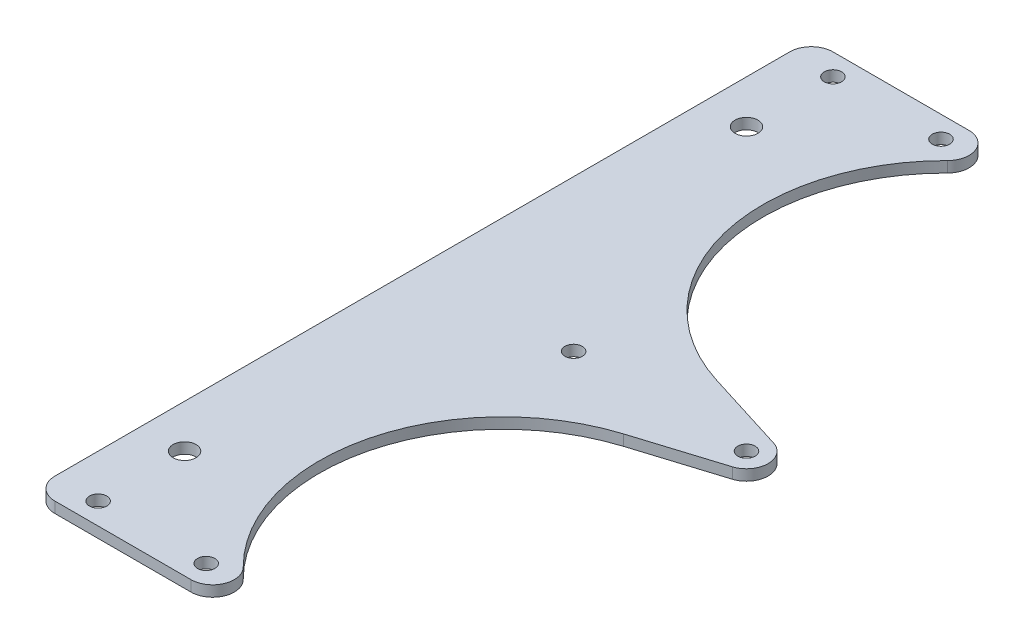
ISO-10303-21;
HEADER;
FILE_DESCRIPTION(('STEP AP214'),'2;1');
FILE_NAME('part.step','',(''),(''),'','','');
FILE_SCHEMA(('AUTOMOTIVE_DESIGN { 1 0 10303 214 1 1 1 1 }'));
ENDSEC;
DATA;
#1=APPLICATION_CONTEXT('core data for automotive mechanical design processes');
#2=APPLICATION_PROTOCOL_DEFINITION('international standard','automotive_design',2000,#1);
#3=PRODUCT_CONTEXT('',#1,'mechanical');
#4=PRODUCT('Part','Part','',(#3));
#5=PRODUCT_RELATED_PRODUCT_CATEGORY('part','',(#4));
#6=PRODUCT_DEFINITION_FORMATION('','',#4);
#7=PRODUCT_DEFINITION_CONTEXT('part definition',#1,'design');
#8=PRODUCT_DEFINITION('design','',#6,#7);
#9=PRODUCT_DEFINITION_SHAPE('','',#8);
#10=(LENGTH_UNIT() NAMED_UNIT(*) SI_UNIT(.MILLI.,.METRE.));
#11=(NAMED_UNIT(*) PLANE_ANGLE_UNIT() SI_UNIT($,.RADIAN.));
#12=(NAMED_UNIT(*) SI_UNIT($,.STERADIAN.) SOLID_ANGLE_UNIT());
#13=UNCERTAINTY_MEASURE_WITH_UNIT(LENGTH_MEASURE(1.E-05),#10,'distance_accuracy_value','');
#14=(GEOMETRIC_REPRESENTATION_CONTEXT(3) GLOBAL_UNCERTAINTY_ASSIGNED_CONTEXT((#13)) GLOBAL_UNIT_ASSIGNED_CONTEXT((#10,
#11,#12)) REPRESENTATION_CONTEXT('',''));
#15=CARTESIAN_POINT('',(0.,0.,0.));
#16=DIRECTION('',(0.,0.,1.));
#17=DIRECTION('',(1.,0.,0.));
#18=AXIS2_PLACEMENT_3D('',#15,#16,#17);
#19=CARTESIAN_POINT('',(46.3487243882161,3.175,-6.35));
#20=DIRECTION('',(0.,-1.,0.));
#21=DIRECTION('',(0.,0.,-1.));
#22=AXIS2_PLACEMENT_3D('',#19,#20,#21);
#23=CYLINDRICAL_SURFACE('',#22,6.35000000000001);
#24=CARTESIAN_POINT('',(46.3487243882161,0.,-6.35));
#25=DIRECTION('',(0.,1.,0.));
#26=DIRECTION('',(0.,0.,1.));
#27=AXIS2_PLACEMENT_3D('',#24,#25,#26);
#28=CIRCLE('',#27,6.35000000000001);
#29=CARTESIAN_POINT('',(46.3487243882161,0.,0.));
#30=VERTEX_POINT('',#29);
#31=CARTESIAN_POINT('',(50.8278060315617,0.,-10.8511473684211));
#32=VERTEX_POINT('',#31);
#33=EDGE_CURVE('E174',#30,#32,#28,.T.);
#34=ORIENTED_EDGE('',*,*,#33,.T.);
#35=DIRECTION('',(0.,-1.,0.));
#36=VECTOR('',#35,1.);
#37=CARTESIAN_POINT('',(50.8278060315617,3.175,-10.8511473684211));
#38=LINE('',#37,#36);
#39=CARTESIAN_POINT('',(50.8278060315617,3.175,-10.8511473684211));
#40=VERTEX_POINT('',#39);
#41=EDGE_CURVE('E13',#40,#32,#38,.T.);
#42=ORIENTED_EDGE('',*,*,#41,.F.);
#43=CARTESIAN_POINT('',(46.3487243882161,3.175,-6.35));
#44=DIRECTION('',(0.,1.,0.));
#45=DIRECTION('',(0.,0.,1.));
#46=AXIS2_PLACEMENT_3D('',#43,#44,#45);
#47=CIRCLE('',#46,6.35000000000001);
#48=CARTESIAN_POINT('',(46.3487243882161,3.175,0.));
#49=VERTEX_POINT('',#48);
#50=EDGE_CURVE('E209',#49,#40,#47,.T.);
#51=ORIENTED_EDGE('',*,*,#50,.F.);
#52=DIRECTION('',(0.,-1.,0.));
#53=VECTOR('',#52,1.);
#54=CARTESIAN_POINT('',(46.3487243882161,3.175,0.));
#55=LINE('',#54,#53);
#56=EDGE_CURVE('E170',#49,#30,#55,.T.);
#57=ORIENTED_EDGE('',*,*,#56,.T.);
#58=EDGE_LOOP('',(#34,#42,#51,#57));
#59=FACE_BOUND('',#58,.T.);
#60=ADVANCED_FACE('F48',(#59),#23,.T.);
#61=CARTESIAN_POINT('',(88.9,3.175,-49.1109));
#62=DIRECTION('',(0.,-1.,0.));
#63=DIRECTION('',(0.,0.,-1.));
#64=AXIS2_PLACEMENT_3D('',#61,#62,#63);
#65=CYLINDRICAL_SURFACE('',#64,53.975);
#66=CARTESIAN_POINT('',(88.9,0.,-49.1109));
#67=DIRECTION('',(0.,-1.,0.));
#68=DIRECTION('',(0.,0.,1.));
#69=AXIS2_PLACEMENT_3D('',#66,#67,#68);
#70=CIRCLE('',#69,53.975);
#71=CARTESIAN_POINT('',(72.7952662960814,0.,-100.627287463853));
#72=VERTEX_POINT('',#71);
#73=EDGE_CURVE('E178',#32,#72,#70,.T.);
#74=ORIENTED_EDGE('',*,*,#73,.T.);
#75=DIRECTION('',(0.,-1.,0.));
#76=VECTOR('',#75,1.);
#77=CARTESIAN_POINT('',(72.7952662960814,3.175,-100.627287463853));
#78=LINE('',#77,#76);
#79=CARTESIAN_POINT('',(72.7952662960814,3.175,-100.627287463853));
#80=VERTEX_POINT('',#79);
#81=EDGE_CURVE('E57',#80,#72,#78,.T.);
#82=ORIENTED_EDGE('',*,*,#81,.F.);
#83=CARTESIAN_POINT('',(88.9,3.175,-49.1109));
#84=DIRECTION('',(0.,-1.,0.));
#85=DIRECTION('',(0.,0.,1.));
#86=AXIS2_PLACEMENT_3D('',#83,#84,#85);
#87=CIRCLE('',#86,53.975);
#88=EDGE_CURVE('E120',#40,#80,#87,.T.);
#89=ORIENTED_EDGE('',*,*,#88,.F.);
#90=ORIENTED_EDGE('',*,*,#41,.T.);
#91=EDGE_LOOP('',(#74,#82,#89,#90));
#92=FACE_BOUND('',#91,.T.);
#93=ADVANCED_FACE('F311',(#92),#65,.F.);
#94=CARTESIAN_POINT('',(97.1446745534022,3.175,-108.239248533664));
#95=DIRECTION('',(-0.298373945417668,0.,-0.954449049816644));
#96=DIRECTION('',(-0.954449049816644,0.,0.298373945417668));
#97=AXIS2_PLACEMENT_3D('',#94,#95,#96);
#98=PLANE('',#97);
#99=DIRECTION('',(0.954449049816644,0.,-0.298373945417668));
#100=VECTOR('',#99,1.);
#101=CARTESIAN_POINT('',(97.1446745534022,0.,-108.239248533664));
#102=LINE('',#101,#100);
#103=CARTESIAN_POINT('',(97.1446745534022,0.,-108.239248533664));
#104=VERTEX_POINT('',#103);
#105=EDGE_CURVE('E182',#72,#104,#102,.T.);
#106=ORIENTED_EDGE('',*,*,#105,.T.);
#107=DIRECTION('',(0.,-1.,0.));
#108=VECTOR('',#107,1.);
#109=CARTESIAN_POINT('',(97.1446745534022,3.175,-108.239248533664));
#110=LINE('',#109,#108);
#111=CARTESIAN_POINT('',(97.1446745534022,3.175,-108.239248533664));
#112=VERTEX_POINT('',#111);
#113=EDGE_CURVE('E236',#112,#104,#110,.T.);
#114=ORIENTED_EDGE('',*,*,#113,.F.);
#115=DIRECTION('',(0.954449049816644,0.,-0.298373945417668));
#116=VECTOR('',#115,1.);
#117=CARTESIAN_POINT('',(97.1446745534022,3.175,-108.239248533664));
#118=LINE('',#117,#116);
#119=EDGE_CURVE('E247',#80,#112,#118,.T.);
#120=ORIENTED_EDGE('',*,*,#119,.F.);
#121=ORIENTED_EDGE('',*,*,#81,.T.);
#122=EDGE_LOOP('',(#106,#114,#120,#121));
#123=FACE_BOUND('',#122,.T.);
#124=ADVANCED_FACE('F245',(#123),#98,.F.);
#125=CARTESIAN_POINT('',(95.25,3.175,-114.3));
#126=DIRECTION('',(0.,-1.,0.));
#127=DIRECTION('',(0.,0.,-1.));
#128=AXIS2_PLACEMENT_3D('',#125,#126,#127);
#129=CYLINDRICAL_SURFACE('',#128,6.35);
#130=CARTESIAN_POINT('',(95.25,0.,-114.3));
#131=DIRECTION('',(0.,1.,0.));
#132=DIRECTION('',(0.,0.,-1.));
#133=AXIS2_PLACEMENT_3D('',#130,#131,#132);
#134=CIRCLE('',#133,6.35);
#135=CARTESIAN_POINT('',(97.1446745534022,0.,-120.360751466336));
#136=VERTEX_POINT('',#135);
#137=EDGE_CURVE('E185',#104,#136,#134,.T.);
#138=ORIENTED_EDGE('',*,*,#137,.T.);
#139=DIRECTION('',(0.,-1.,0.));
#140=VECTOR('',#139,1.);
#141=CARTESIAN_POINT('',(97.1446745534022,3.175,-120.360751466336));
#142=LINE('',#141,#140);
#143=CARTESIAN_POINT('',(97.1446745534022,3.175,-120.360751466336));
#144=VERTEX_POINT('',#143);
#145=EDGE_CURVE('E232',#144,#136,#142,.T.);
#146=ORIENTED_EDGE('',*,*,#145,.F.);
#147=CARTESIAN_POINT('',(95.25,3.175,-114.3));
#148=DIRECTION('',(0.,1.,0.));
#149=DIRECTION('',(0.,0.,-1.));
#150=AXIS2_PLACEMENT_3D('',#147,#148,#149);
#151=CIRCLE('',#150,6.35);
#152=EDGE_CURVE('E266',#112,#144,#151,.T.);
#153=ORIENTED_EDGE('',*,*,#152,.F.);
#154=ORIENTED_EDGE('',*,*,#113,.T.);
#155=EDGE_LOOP('',(#138,#146,#153,#154));
#156=FACE_BOUND('',#155,.T.);
#157=ADVANCED_FACE('F256',(#156),#129,.T.);
#158=CARTESIAN_POINT('',(72.7952662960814,3.175,-127.972712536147));
#159=DIRECTION('',(-0.298373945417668,0.,0.954449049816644));
#160=DIRECTION('',(0.954449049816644,0.,0.298373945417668));
#161=AXIS2_PLACEMENT_3D('',#158,#159,#160);
#162=PLANE('',#161);
#163=DIRECTION('',(-0.954449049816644,0.,-0.298373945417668));
#164=VECTOR('',#163,1.);
#165=CARTESIAN_POINT('',(72.7952662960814,0.,-127.972712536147));
#166=LINE('',#165,#164);
#167=CARTESIAN_POINT('',(72.7952662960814,0.,-127.972712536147));
#168=VERTEX_POINT('',#167);
#169=EDGE_CURVE('E188',#136,#168,#166,.T.);
#170=ORIENTED_EDGE('',*,*,#169,.T.);
#171=DIRECTION('',(0.,-1.,0.));
#172=VECTOR('',#171,1.);
#173=CARTESIAN_POINT('',(72.7952662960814,3.175,-127.972712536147));
#174=LINE('',#173,#172);
#175=CARTESIAN_POINT('',(72.7952662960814,3.175,-127.972712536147));
#176=VERTEX_POINT('',#175);
#177=EDGE_CURVE('E228',#176,#168,#174,.T.);
#178=ORIENTED_EDGE('',*,*,#177,.F.);
#179=DIRECTION('',(-0.954449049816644,0.,-0.298373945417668));
#180=VECTOR('',#179,1.);
#181=CARTESIAN_POINT('',(72.7952662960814,3.175,-127.972712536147));
#182=LINE('',#181,#180);
#183=EDGE_CURVE('E262',#144,#176,#182,.T.);
#184=ORIENTED_EDGE('',*,*,#183,.F.);
#185=ORIENTED_EDGE('',*,*,#145,.T.);
#186=EDGE_LOOP('',(#170,#178,#184,#185));
#187=FACE_BOUND('',#186,.T.);
#188=ADVANCED_FACE('F260',(#187),#162,.F.);
#189=CARTESIAN_POINT('',(88.9,3.175,-179.4891));
#190=DIRECTION('',(0.,-1.,0.));
#191=DIRECTION('',(0.,0.,-1.));
#192=AXIS2_PLACEMENT_3D('',#189,#190,#191);
#193=CYLINDRICAL_SURFACE('',#192,53.975);
#194=CARTESIAN_POINT('',(88.9,0.,-179.4891));
#195=DIRECTION('',(0.,-1.,0.));
#196=DIRECTION('',(0.,0.,1.));
#197=AXIS2_PLACEMENT_3D('',#194,#195,#196);
#198=CIRCLE('',#197,53.975);
#199=CARTESIAN_POINT('',(50.8278060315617,0.,-217.748852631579));
#200=VERTEX_POINT('',#199);
#201=EDGE_CURVE('E191',#168,#200,#198,.T.);
#202=ORIENTED_EDGE('',*,*,#201,.T.);
#203=DIRECTION('',(0.,-1.,0.));
#204=VECTOR('',#203,1.);
#205=CARTESIAN_POINT('',(50.8278060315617,3.175,-217.748852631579));
#206=LINE('',#205,#204);
#207=CARTESIAN_POINT('',(50.8278060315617,3.175,-217.748852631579));
#208=VERTEX_POINT('',#207);
#209=EDGE_CURVE('E224',#208,#200,#206,.T.);
#210=ORIENTED_EDGE('',*,*,#209,.F.);
#211=CARTESIAN_POINT('',(88.9,3.175,-179.4891));
#212=DIRECTION('',(0.,-1.,0.));
#213=DIRECTION('',(0.,0.,1.));
#214=AXIS2_PLACEMENT_3D('',#211,#212,#213);
#215=CIRCLE('',#214,53.975);
#216=EDGE_CURVE('E265',#176,#208,#215,.T.);
#217=ORIENTED_EDGE('',*,*,#216,.F.);
#218=ORIENTED_EDGE('',*,*,#177,.T.);
#219=EDGE_LOOP('',(#202,#210,#217,#218));
#220=FACE_BOUND('',#219,.T.);
#221=ADVANCED_FACE('F324',(#220),#193,.F.);
#222=CARTESIAN_POINT('',(46.348724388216,3.175,-222.25));
#223=DIRECTION('',(0.,-1.,0.));
#224=DIRECTION('',(0.,0.,-1.));
#225=AXIS2_PLACEMENT_3D('',#222,#223,#224);
#226=CYLINDRICAL_SURFACE('',#225,6.35);
#227=CARTESIAN_POINT('',(46.348724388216,0.,-222.25));
#228=DIRECTION('',(0.,1.,0.));
#229=DIRECTION('',(0.,0.,1.));
#230=AXIS2_PLACEMENT_3D('',#227,#228,#229);
#231=CIRCLE('',#230,6.35);
#232=CARTESIAN_POINT('',(46.348724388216,0.,-228.6));
#233=VERTEX_POINT('',#232);
#234=EDGE_CURVE('E194',#200,#233,#231,.T.);
#235=ORIENTED_EDGE('',*,*,#234,.T.);
#236=DIRECTION('',(0.,-1.,0.));
#237=VECTOR('',#236,1.);
#238=CARTESIAN_POINT('',(46.348724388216,3.175,-228.6));
#239=LINE('',#238,#237);
#240=CARTESIAN_POINT('',(46.348724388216,3.175,-228.6));
#241=VERTEX_POINT('',#240);
#242=EDGE_CURVE('E220',#241,#233,#239,.T.);
#243=ORIENTED_EDGE('',*,*,#242,.F.);
#244=CARTESIAN_POINT('',(46.348724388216,3.175,-222.25));
#245=DIRECTION('',(0.,1.,0.));
#246=DIRECTION('',(0.,0.,1.));
#247=AXIS2_PLACEMENT_3D('',#244,#245,#246);
#248=CIRCLE('',#247,6.35);
#249=EDGE_CURVE('E271',#208,#241,#248,.T.);
#250=ORIENTED_EDGE('',*,*,#249,.F.);
#251=ORIENTED_EDGE('',*,*,#209,.T.);
#252=EDGE_LOOP('',(#235,#243,#250,#251));
#253=FACE_BOUND('',#252,.T.);
#254=ADVANCED_FACE('F327',(#253),#226,.T.);
#255=CARTESIAN_POINT('',(6.35000000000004,3.175,-228.6));
#256=DIRECTION('',(0.,0.,1.));
#257=DIRECTION('',(1.,0.,0.));
#258=AXIS2_PLACEMENT_3D('',#255,#256,#257);
#259=PLANE('',#258);
#260=DIRECTION('',(-1.,0.,0.));
#261=VECTOR('',#260,1.);
#262=CARTESIAN_POINT('',(6.35000000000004,0.,-228.6));
#263=LINE('',#262,#261);
#264=CARTESIAN_POINT('',(6.35,0.,-228.6));
#265=VERTEX_POINT('',#264);
#266=EDGE_CURVE('E197',#233,#265,#263,.T.);
#267=ORIENTED_EDGE('',*,*,#266,.T.);
#268=DIRECTION('',(0.,-1.,0.));
#269=VECTOR('',#268,1.);
#270=CARTESIAN_POINT('',(6.35,3.175,-228.6));
#271=LINE('',#270,#269);
#272=CARTESIAN_POINT('',(6.35,3.175,-228.6));
#273=VERTEX_POINT('',#272);
#274=EDGE_CURVE('E216',#273,#265,#271,.T.);
#275=ORIENTED_EDGE('',*,*,#274,.F.);
#276=DIRECTION('',(-1.,0.,0.));
#277=VECTOR('',#276,1.);
#278=CARTESIAN_POINT('',(6.35000000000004,3.175,-228.6));
#279=LINE('',#278,#277);
#280=EDGE_CURVE('E278',#241,#273,#279,.T.);
#281=ORIENTED_EDGE('',*,*,#280,.F.);
#282=ORIENTED_EDGE('',*,*,#242,.T.);
#283=EDGE_LOOP('',(#267,#275,#281,#282));
#284=FACE_BOUND('',#283,.T.);
#285=ADVANCED_FACE('F291',(#284),#259,.F.);
#286=CARTESIAN_POINT('',(6.35,3.175,-222.25));
#287=DIRECTION('',(0.,-1.,0.));
#288=DIRECTION('',(0.,0.,-1.));
#289=AXIS2_PLACEMENT_3D('',#286,#287,#288);
#290=CYLINDRICAL_SURFACE('',#289,6.35);
#291=CARTESIAN_POINT('',(6.35,0.,-222.25));
#292=DIRECTION('',(0.,1.,0.));
#293=DIRECTION('',(0.,0.,-1.));
#294=AXIS2_PLACEMENT_3D('',#291,#292,#293);
#295=CIRCLE('',#294,6.35);
#296=CARTESIAN_POINT('',(0.,0.,-222.25));
#297=VERTEX_POINT('',#296);
#298=EDGE_CURVE('E200',#265,#297,#295,.T.);
#299=ORIENTED_EDGE('',*,*,#298,.T.);
#300=DIRECTION('',(0.,-1.,0.));
#301=VECTOR('',#300,1.);
#302=CARTESIAN_POINT('',(0.,3.175,-222.25));
#303=LINE('',#302,#301);
#304=CARTESIAN_POINT('',(0.,3.175,-222.25));
#305=VERTEX_POINT('',#304);
#306=EDGE_CURVE('E162',#305,#297,#303,.T.);
#307=ORIENTED_EDGE('',*,*,#306,.F.);
#308=CARTESIAN_POINT('',(6.35,3.175,-222.25));
#309=DIRECTION('',(0.,1.,0.));
#310=DIRECTION('',(0.,0.,-1.));
#311=AXIS2_PLACEMENT_3D('',#308,#309,#310);
#312=CIRCLE('',#311,6.35);
#313=EDGE_CURVE('E151',#273,#305,#312,.T.);
#314=ORIENTED_EDGE('',*,*,#313,.F.);
#315=ORIENTED_EDGE('',*,*,#274,.T.);
#316=EDGE_LOOP('',(#299,#307,#314,#315));
#317=FACE_BOUND('',#316,.T.);
#318=ADVANCED_FACE('F295',(#317),#290,.T.);
#319=CARTESIAN_POINT('',(0.,3.175,-6.35000000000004));
#320=DIRECTION('',(1.,0.,0.));
#321=DIRECTION('',(0.,0.,-1.));
#322=AXIS2_PLACEMENT_3D('',#319,#320,#321);
#323=PLANE('',#322);
#324=DIRECTION('',(0.,0.,1.));
#325=VECTOR('',#324,1.);
#326=CARTESIAN_POINT('',(0.,0.,-6.35000000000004));
#327=LINE('',#326,#325);
#328=CARTESIAN_POINT('',(0.,0.,-6.35000000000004));
#329=VERTEX_POINT('',#328);
#330=EDGE_CURVE('E160',#297,#329,#327,.T.);
#331=ORIENTED_EDGE('',*,*,#330,.T.);
#332=DIRECTION('',(0.,-1.,0.));
#333=VECTOR('',#332,1.);
#334=CARTESIAN_POINT('',(0.,3.175,-6.35000000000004));
#335=LINE('',#334,#333);
#336=CARTESIAN_POINT('',(0.,3.175,-6.35000000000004));
#337=VERTEX_POINT('',#336);
#338=EDGE_CURVE('E157',#337,#329,#335,.T.);
#339=ORIENTED_EDGE('',*,*,#338,.F.);
#340=DIRECTION('',(0.,0.,1.));
#341=VECTOR('',#340,1.);
#342=CARTESIAN_POINT('',(0.,3.175,-6.35000000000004));
#343=LINE('',#342,#341);
#344=EDGE_CURVE('E145',#305,#337,#343,.T.);
#345=ORIENTED_EDGE('',*,*,#344,.F.);
#346=ORIENTED_EDGE('',*,*,#306,.T.);
#347=EDGE_LOOP('',(#331,#339,#345,#346));
#348=FACE_BOUND('',#347,.T.);
#349=ADVANCED_FACE('F158',(#348),#323,.F.);
#350=CARTESIAN_POINT('',(6.35,3.175,-6.35));
#351=DIRECTION('',(0.,-1.,0.));
#352=DIRECTION('',(0.,0.,-1.));
#353=AXIS2_PLACEMENT_3D('',#350,#351,#352);
#354=CYLINDRICAL_SURFACE('',#353,6.35);
#355=CARTESIAN_POINT('',(6.35,0.,-6.35));
#356=DIRECTION('',(0.,1.,0.));
#357=DIRECTION('',(0.,0.,1.));
#358=AXIS2_PLACEMENT_3D('',#355,#356,#357);
#359=CIRCLE('',#358,6.35);
#360=CARTESIAN_POINT('',(6.35000000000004,0.,0.));
#361=VERTEX_POINT('',#360);
#362=EDGE_CURVE('E106',#329,#361,#359,.T.);
#363=ORIENTED_EDGE('',*,*,#362,.T.);
#364=DIRECTION('',(0.,-1.,0.));
#365=VECTOR('',#364,1.);
#366=CARTESIAN_POINT('',(6.35000000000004,3.175,0.));
#367=LINE('',#366,#365);
#368=CARTESIAN_POINT('',(6.35000000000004,3.175,0.));
#369=VERTEX_POINT('',#368);
#370=EDGE_CURVE('E163',#369,#361,#367,.T.);
#371=ORIENTED_EDGE('',*,*,#370,.F.);
#372=CARTESIAN_POINT('',(6.35,3.175,-6.35));
#373=DIRECTION('',(0.,1.,0.));
#374=DIRECTION('',(0.,0.,1.));
#375=AXIS2_PLACEMENT_3D('',#372,#373,#374);
#376=CIRCLE('',#375,6.35);
#377=EDGE_CURVE('E149',#337,#369,#376,.T.);
#378=ORIENTED_EDGE('',*,*,#377,.F.);
#379=ORIENTED_EDGE('',*,*,#338,.T.);
#380=EDGE_LOOP('',(#363,#371,#378,#379));
#381=FACE_BOUND('',#380,.T.);
#382=ADVANCED_FACE('F165',(#381),#354,.T.);
#383=CARTESIAN_POINT('',(6.35000000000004,3.175,0.));
#384=DIRECTION('',(0.,0.,-1.));
#385=DIRECTION('',(-1.,0.,0.));
#386=AXIS2_PLACEMENT_3D('',#383,#384,#385);
#387=PLANE('',#386);
#388=DIRECTION('',(1.,0.,0.));
#389=VECTOR('',#388,1.);
#390=CARTESIAN_POINT('',(6.35000000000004,0.,0.));
#391=LINE('',#390,#389);
#392=EDGE_CURVE('E112',#361,#30,#391,.T.);
#393=ORIENTED_EDGE('',*,*,#392,.T.);
#394=ORIENTED_EDGE('',*,*,#56,.F.);
#395=DIRECTION('',(1.,0.,0.));
#396=VECTOR('',#395,1.);
#397=CARTESIAN_POINT('',(6.35000000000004,3.175,0.));
#398=LINE('',#397,#396);
#399=EDGE_CURVE('E65',#369,#49,#398,.T.);
#400=ORIENTED_EDGE('',*,*,#399,.F.);
#401=ORIENTED_EDGE('',*,*,#370,.T.);
#402=EDGE_LOOP('',(#393,#394,#400,#401));
#403=FACE_BOUND('',#402,.T.);
#404=ADVANCED_FACE('F299',(#403),#387,.F.);
#405=CARTESIAN_POINT('',(46.3487243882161,3.175,-6.35));
#406=DIRECTION('',(0.,1.,0.));
#407=DIRECTION('',(0.,0.,1.));
#408=AXIS2_PLACEMENT_3D('',#405,#406,#407);
#409=PLANE('',#408);
#410=CARTESIAN_POINT('',(12.7,3.175,-196.85));
#411=DIRECTION('',(0.,1.,0.));
#412=DIRECTION('',(0.,0.,1.));
#413=AXIS2_PLACEMENT_3D('',#410,#411,#412);
#414=CIRCLE('',#413,3.37350099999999);
#415=CARTESIAN_POINT('',(12.7,3.175,-193.476499));
#416=VERTEX_POINT('',#415);
#417=EDGE_CURVE('E547',#416,#416,#414,.T.);
#418=ORIENTED_EDGE('',*,*,#417,.F.);
#419=EDGE_LOOP('',(#418));
#420=FACE_BOUND('',#419,.T.);
#421=CARTESIAN_POINT('',(12.7,3.175,-31.75));
#422=DIRECTION('',(0.,1.,0.));
#423=DIRECTION('',(0.,0.,1.));
#424=AXIS2_PLACEMENT_3D('',#421,#422,#423);
#425=CIRCLE('',#424,3.37350099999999);
#426=CARTESIAN_POINT('',(12.7,3.175,-28.376499));
#427=VERTEX_POINT('',#426);
#428=EDGE_CURVE('E552',#427,#427,#425,.T.);
#429=ORIENTED_EDGE('',*,*,#428,.F.);
#430=EDGE_LOOP('',(#429));
#431=FACE_BOUND('',#430,.T.);
#432=CARTESIAN_POINT('',(95.25,3.175,-114.3));
#433=DIRECTION('',(0.,1.,0.));
#434=DIRECTION('',(0.,0.,1.));
#435=AXIS2_PLACEMENT_3D('',#432,#433,#434);
#436=CIRCLE('',#435,2.55269999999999);
#437=CARTESIAN_POINT('',(95.25,3.175,-111.7473));
#438=VERTEX_POINT('',#437);
#439=EDGE_CURVE('E562',#438,#438,#436,.T.);
#440=ORIENTED_EDGE('',*,*,#439,.F.);
#441=EDGE_LOOP('',(#440));
#442=FACE_BOUND('',#441,.T.);
#443=CARTESIAN_POINT('',(44.45,3.175,-114.3));
#444=DIRECTION('',(0.,1.,0.));
#445=DIRECTION('',(0.,0.,1.));
#446=AXIS2_PLACEMENT_3D('',#443,#444,#445);
#447=CIRCLE('',#446,2.55269999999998);
#448=CARTESIAN_POINT('',(44.45,3.175,-111.7473));
#449=VERTEX_POINT('',#448);
#450=EDGE_CURVE('E570',#449,#449,#447,.T.);
#451=ORIENTED_EDGE('',*,*,#450,.F.);
#452=EDGE_LOOP('',(#451));
#453=FACE_BOUND('',#452,.T.);
#454=CARTESIAN_POINT('',(12.7,3.175,-222.25));
#455=DIRECTION('',(0.,1.,0.));
#456=DIRECTION('',(0.,0.,1.));
#457=AXIS2_PLACEMENT_3D('',#454,#455,#456);
#458=CIRCLE('',#457,2.55269999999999);
#459=CARTESIAN_POINT('',(12.7,3.175,-219.6973));
#460=VERTEX_POINT('',#459);
#461=EDGE_CURVE('E578',#460,#460,#458,.T.);
#462=ORIENTED_EDGE('',*,*,#461,.F.);
#463=EDGE_LOOP('',(#462));
#464=FACE_BOUND('',#463,.T.);
#465=CARTESIAN_POINT('',(12.7,3.175,-6.35));
#466=DIRECTION('',(0.,1.,0.));
#467=DIRECTION('',(0.,0.,1.));
#468=AXIS2_PLACEMENT_3D('',#465,#466,#467);
#469=CIRCLE('',#468,2.55269999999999);
#470=CARTESIAN_POINT('',(12.7,3.175,-3.79730000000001));
#471=VERTEX_POINT('',#470);
#472=EDGE_CURVE('E586',#471,#471,#469,.T.);
#473=ORIENTED_EDGE('',*,*,#472,.F.);
#474=EDGE_LOOP('',(#473));
#475=FACE_BOUND('',#474,.T.);
#476=CARTESIAN_POINT('',(44.45,3.175,-6.35));
#477=DIRECTION('',(0.,1.,0.));
#478=DIRECTION('',(0.,0.,1.));
#479=AXIS2_PLACEMENT_3D('',#476,#477,#478);
#480=CIRCLE('',#479,2.55269999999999);
#481=CARTESIAN_POINT('',(44.45,3.175,-3.79730000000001));
#482=VERTEX_POINT('',#481);
#483=EDGE_CURVE('E594',#482,#482,#480,.T.);
#484=ORIENTED_EDGE('',*,*,#483,.F.);
#485=EDGE_LOOP('',(#484));
#486=FACE_BOUND('',#485,.T.);
#487=CARTESIAN_POINT('',(44.45,3.175,-222.25));
#488=DIRECTION('',(0.,1.,0.));
#489=DIRECTION('',(0.,0.,1.));
#490=AXIS2_PLACEMENT_3D('',#487,#488,#489);
#491=CIRCLE('',#490,2.55269999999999);
#492=CARTESIAN_POINT('',(44.45,3.175,-219.6973));
#493=VERTEX_POINT('',#492);
#494=EDGE_CURVE('E602',#493,#493,#491,.T.);
#495=ORIENTED_EDGE('',*,*,#494,.F.);
#496=EDGE_LOOP('',(#495));
#497=FACE_BOUND('',#496,.T.);
#498=ORIENTED_EDGE('',*,*,#50,.T.);
#499=ORIENTED_EDGE('',*,*,#88,.T.);
#500=ORIENTED_EDGE('',*,*,#119,.T.);
#501=ORIENTED_EDGE('',*,*,#152,.T.);
#502=ORIENTED_EDGE('',*,*,#183,.T.);
#503=ORIENTED_EDGE('',*,*,#216,.T.);
#504=ORIENTED_EDGE('',*,*,#249,.T.);
#505=ORIENTED_EDGE('',*,*,#280,.T.);
#506=ORIENTED_EDGE('',*,*,#313,.T.);
#507=ORIENTED_EDGE('',*,*,#344,.T.);
#508=ORIENTED_EDGE('',*,*,#377,.T.);
#509=ORIENTED_EDGE('',*,*,#399,.T.);
#510=EDGE_LOOP('',(#498,#499,#500,#501,#502,#503,#504,#505,#506,#507,#508,#509));
#511=FACE_BOUND('',#510,.T.);
#512=ADVANCED_FACE('F147',(#420,#431,#442,#453,#464,#475,#486,#497,#511),#409,.T.);
#513=CARTESIAN_POINT('',(46.3487243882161,0.,-6.35));
#514=DIRECTION('',(0.,1.,0.));
#515=DIRECTION('',(0.,0.,1.));
#516=AXIS2_PLACEMENT_3D('',#513,#514,#515);
#517=PLANE('',#516);
#518=CARTESIAN_POINT('',(12.7,0.,-196.85));
#519=DIRECTION('',(0.,1.,0.));
#520=DIRECTION('',(0.,0.,1.));
#521=AXIS2_PLACEMENT_3D('',#518,#519,#520);
#522=CIRCLE('',#521,3.37350099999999);
#523=CARTESIAN_POINT('',(12.7,0.,-193.476499));
#524=VERTEX_POINT('',#523);
#525=EDGE_CURVE('E544',#524,#524,#522,.T.);
#526=ORIENTED_EDGE('',*,*,#525,.T.);
#527=EDGE_LOOP('',(#526));
#528=FACE_BOUND('',#527,.T.);
#529=CARTESIAN_POINT('',(12.7,0.,-31.75));
#530=DIRECTION('',(0.,1.,0.));
#531=DIRECTION('',(0.,0.,1.));
#532=AXIS2_PLACEMENT_3D('',#529,#530,#531);
#533=CIRCLE('',#532,3.37350099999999);
#534=CARTESIAN_POINT('',(12.7,0.,-28.376499));
#535=VERTEX_POINT('',#534);
#536=EDGE_CURVE('E558',#535,#535,#533,.T.);
#537=ORIENTED_EDGE('',*,*,#536,.T.);
#538=EDGE_LOOP('',(#537));
#539=FACE_BOUND('',#538,.T.);
#540=CARTESIAN_POINT('',(95.25,0.,-114.3));
#541=DIRECTION('',(0.,1.,0.));
#542=DIRECTION('',(0.,0.,1.));
#543=AXIS2_PLACEMENT_3D('',#540,#541,#542);
#544=CIRCLE('',#543,2.55269999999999);
#545=CARTESIAN_POINT('',(95.25,0.,-111.7473));
#546=VERTEX_POINT('',#545);
#547=EDGE_CURVE('E566',#546,#546,#544,.T.);
#548=ORIENTED_EDGE('',*,*,#547,.T.);
#549=EDGE_LOOP('',(#548));
#550=FACE_BOUND('',#549,.T.);
#551=CARTESIAN_POINT('',(44.45,0.,-114.3));
#552=DIRECTION('',(0.,1.,0.));
#553=DIRECTION('',(0.,0.,1.));
#554=AXIS2_PLACEMENT_3D('',#551,#552,#553);
#555=CIRCLE('',#554,2.5527);
#556=CARTESIAN_POINT('',(44.45,0.,-111.7473));
#557=VERTEX_POINT('',#556);
#558=EDGE_CURVE('E574',#557,#557,#555,.T.);
#559=ORIENTED_EDGE('',*,*,#558,.T.);
#560=EDGE_LOOP('',(#559));
#561=FACE_BOUND('',#560,.T.);
#562=CARTESIAN_POINT('',(12.7,0.,-222.25));
#563=DIRECTION('',(0.,1.,0.));
#564=DIRECTION('',(0.,0.,1.));
#565=AXIS2_PLACEMENT_3D('',#562,#563,#564);
#566=CIRCLE('',#565,2.55269999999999);
#567=CARTESIAN_POINT('',(12.7,0.,-219.6973));
#568=VERTEX_POINT('',#567);
#569=EDGE_CURVE('E582',#568,#568,#566,.T.);
#570=ORIENTED_EDGE('',*,*,#569,.T.);
#571=EDGE_LOOP('',(#570));
#572=FACE_BOUND('',#571,.T.);
#573=CARTESIAN_POINT('',(12.7,0.,-6.35));
#574=DIRECTION('',(0.,1.,0.));
#575=DIRECTION('',(0.,0.,1.));
#576=AXIS2_PLACEMENT_3D('',#573,#574,#575);
#577=CIRCLE('',#576,2.55269999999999);
#578=CARTESIAN_POINT('',(12.7,0.,-3.79730000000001));
#579=VERTEX_POINT('',#578);
#580=EDGE_CURVE('E590',#579,#579,#577,.T.);
#581=ORIENTED_EDGE('',*,*,#580,.T.);
#582=EDGE_LOOP('',(#581));
#583=FACE_BOUND('',#582,.T.);
#584=CARTESIAN_POINT('',(44.45,0.,-6.35));
#585=DIRECTION('',(0.,1.,0.));
#586=DIRECTION('',(0.,0.,1.));
#587=AXIS2_PLACEMENT_3D('',#584,#585,#586);
#588=CIRCLE('',#587,2.5527);
#589=CARTESIAN_POINT('',(44.45,0.,-3.7973));
#590=VERTEX_POINT('',#589);
#591=EDGE_CURVE('E598',#590,#590,#588,.T.);
#592=ORIENTED_EDGE('',*,*,#591,.T.);
#593=EDGE_LOOP('',(#592));
#594=FACE_BOUND('',#593,.T.);
#595=CARTESIAN_POINT('',(44.45,0.,-222.25));
#596=DIRECTION('',(0.,1.,0.));
#597=DIRECTION('',(0.,0.,1.));
#598=AXIS2_PLACEMENT_3D('',#595,#596,#597);
#599=CIRCLE('',#598,2.5527);
#600=CARTESIAN_POINT('',(44.45,0.,-219.6973));
#601=VERTEX_POINT('',#600);
#602=EDGE_CURVE('E179',#601,#601,#599,.T.);
#603=ORIENTED_EDGE('',*,*,#602,.T.);
#604=EDGE_LOOP('',(#603));
#605=FACE_BOUND('',#604,.T.);
#606=ORIENTED_EDGE('',*,*,#33,.F.);
#607=ORIENTED_EDGE('',*,*,#392,.F.);
#608=ORIENTED_EDGE('',*,*,#362,.F.);
#609=ORIENTED_EDGE('',*,*,#330,.F.);
#610=ORIENTED_EDGE('',*,*,#298,.F.);
#611=ORIENTED_EDGE('',*,*,#266,.F.);
#612=ORIENTED_EDGE('',*,*,#234,.F.);
#613=ORIENTED_EDGE('',*,*,#201,.F.);
#614=ORIENTED_EDGE('',*,*,#169,.F.);
#615=ORIENTED_EDGE('',*,*,#137,.F.);
#616=ORIENTED_EDGE('',*,*,#105,.F.);
#617=ORIENTED_EDGE('',*,*,#73,.F.);
#618=EDGE_LOOP('',(#606,#607,#608,#609,#610,#611,#612,#613,#614,#615,#616,#617));
#619=FACE_BOUND('',#618,.T.);
#620=ADVANCED_FACE('F251',(#528,#539,#550,#561,#572,#583,#594,#605,#619),#517,.F.);
#621=CARTESIAN_POINT('',(44.45,3.175,-222.25));
#622=DIRECTION('',(0.,1.,0.));
#623=DIRECTION('',(0.,0.,1.));
#624=AXIS2_PLACEMENT_3D('',#621,#622,#623);
#625=CYLINDRICAL_SURFACE('',#624,2.55269999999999);
#626=ORIENTED_EDGE('',*,*,#602,.F.);
#627=EDGE_LOOP('',(#626));
#628=FACE_BOUND('',#627,.T.);
#629=ORIENTED_EDGE('',*,*,#494,.T.);
#630=EDGE_LOOP('',(#629));
#631=FACE_BOUND('',#630,.T.);
#632=ADVANCED_FACE('F366',(#628,#631),#625,.F.);
#633=CARTESIAN_POINT('',(44.45,3.175,-6.35));
#634=DIRECTION('',(0.,1.,0.));
#635=DIRECTION('',(0.,0.,1.));
#636=AXIS2_PLACEMENT_3D('',#633,#634,#635);
#637=CYLINDRICAL_SURFACE('',#636,2.55269999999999);
#638=ORIENTED_EDGE('',*,*,#591,.F.);
#639=EDGE_LOOP('',(#638));
#640=FACE_BOUND('',#639,.T.);
#641=ORIENTED_EDGE('',*,*,#483,.T.);
#642=EDGE_LOOP('',(#641));
#643=FACE_BOUND('',#642,.T.);
#644=ADVANCED_FACE('F375',(#640,#643),#637,.F.);
#645=CARTESIAN_POINT('',(12.7,3.175,-6.35));
#646=DIRECTION('',(0.,1.,0.));
#647=DIRECTION('',(0.,0.,1.));
#648=AXIS2_PLACEMENT_3D('',#645,#646,#647);
#649=CYLINDRICAL_SURFACE('',#648,2.55269999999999);
#650=ORIENTED_EDGE('',*,*,#580,.F.);
#651=EDGE_LOOP('',(#650));
#652=FACE_BOUND('',#651,.T.);
#653=ORIENTED_EDGE('',*,*,#472,.T.);
#654=EDGE_LOOP('',(#653));
#655=FACE_BOUND('',#654,.T.);
#656=ADVANCED_FACE('F385',(#652,#655),#649,.F.);
#657=CARTESIAN_POINT('',(12.7,3.175,-222.25));
#658=DIRECTION('',(0.,1.,0.));
#659=DIRECTION('',(0.,0.,1.));
#660=AXIS2_PLACEMENT_3D('',#657,#658,#659);
#661=CYLINDRICAL_SURFACE('',#660,2.55269999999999);
#662=ORIENTED_EDGE('',*,*,#569,.F.);
#663=EDGE_LOOP('',(#662));
#664=FACE_BOUND('',#663,.T.);
#665=ORIENTED_EDGE('',*,*,#461,.T.);
#666=EDGE_LOOP('',(#665));
#667=FACE_BOUND('',#666,.T.);
#668=ADVANCED_FACE('F395',(#664,#667),#661,.F.);
#669=CARTESIAN_POINT('',(44.45,3.175,-114.3));
#670=DIRECTION('',(0.,1.,0.));
#671=DIRECTION('',(0.,0.,1.));
#672=AXIS2_PLACEMENT_3D('',#669,#670,#671);
#673=CYLINDRICAL_SURFACE('',#672,2.55269999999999);
#674=ORIENTED_EDGE('',*,*,#558,.F.);
#675=EDGE_LOOP('',(#674));
#676=FACE_BOUND('',#675,.T.);
#677=ORIENTED_EDGE('',*,*,#450,.T.);
#678=EDGE_LOOP('',(#677));
#679=FACE_BOUND('',#678,.T.);
#680=ADVANCED_FACE('F405',(#676,#679),#673,.F.);
#681=CARTESIAN_POINT('',(95.25,3.175,-114.3));
#682=DIRECTION('',(0.,1.,0.));
#683=DIRECTION('',(0.,0.,1.));
#684=AXIS2_PLACEMENT_3D('',#681,#682,#683);
#685=CYLINDRICAL_SURFACE('',#684,2.55269999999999);
#686=ORIENTED_EDGE('',*,*,#547,.F.);
#687=EDGE_LOOP('',(#686));
#688=FACE_BOUND('',#687,.T.);
#689=ORIENTED_EDGE('',*,*,#439,.T.);
#690=EDGE_LOOP('',(#689));
#691=FACE_BOUND('',#690,.T.);
#692=ADVANCED_FACE('F415',(#688,#691),#685,.F.);
#693=CARTESIAN_POINT('',(12.7,3.175,-31.75));
#694=DIRECTION('',(0.,1.,0.));
#695=DIRECTION('',(0.,0.,1.));
#696=AXIS2_PLACEMENT_3D('',#693,#694,#695);
#697=CYLINDRICAL_SURFACE('',#696,3.37350099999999);
#698=ORIENTED_EDGE('',*,*,#536,.F.);
#699=EDGE_LOOP('',(#698));
#700=FACE_BOUND('',#699,.T.);
#701=ORIENTED_EDGE('',*,*,#428,.T.);
#702=EDGE_LOOP('',(#701));
#703=FACE_BOUND('',#702,.T.);
#704=ADVANCED_FACE('F424',(#700,#703),#697,.F.);
#705=CARTESIAN_POINT('',(12.7,3.175,-196.85));
#706=DIRECTION('',(0.,1.,0.));
#707=DIRECTION('',(0.,0.,1.));
#708=AXIS2_PLACEMENT_3D('',#705,#706,#707);
#709=CYLINDRICAL_SURFACE('',#708,3.37350099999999);
#710=ORIENTED_EDGE('',*,*,#525,.F.);
#711=EDGE_LOOP('',(#710));
#712=FACE_BOUND('',#711,.T.);
#713=ORIENTED_EDGE('',*,*,#417,.T.);
#714=EDGE_LOOP('',(#713));
#715=FACE_BOUND('',#714,.T.);
#716=ADVANCED_FACE('F433',(#712,#715),#709,.F.);
#717=CLOSED_SHELL('',(#60,#93,#124,#157,#188,#221,#254,#285,#318,#349,#382,#404,#512,#620,#632,
#644,#656,#668,#680,#692,#704,#716));
#718=MANIFOLD_SOLID_BREP('B2',#717);
#719=ADVANCED_BREP_SHAPE_REPRESENTATION('',(#18,#718),#14);
#720=SHAPE_DEFINITION_REPRESENTATION(#9,#719);
ENDSEC;
END-ISO-10303-21;
